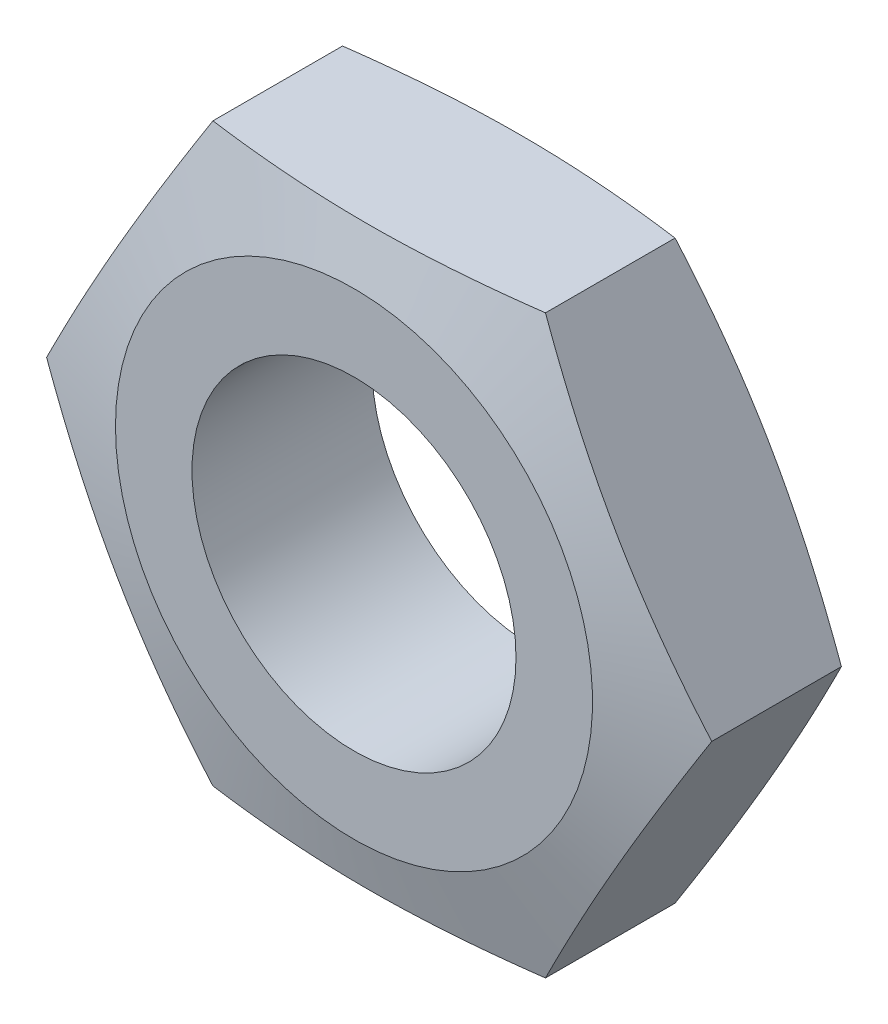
from build123d import *

# Parameters (mm, degrees)
ESQUISSE1_R          = 4.5
BASE_EXTRUSION_DEPTH = 2.5


with BuildPart() as part:
    # Esquisse1 → Base-Extrusion (new, symmetric)
    with BuildSketch(Plane.XY):
        Polygon((-4.618802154, 8), (4.618802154, 8), (9.237604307, 0), (4.618802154, -8), (-4.618802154, -8), (-9.237604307, 0), align=None)
        Circle(ESQUISSE1_R, mode=Mode.SUBTRACT)
    extrude(amount=BASE_EXTRUSION_DEPTH, both=True)

    # Esquisse2 → Enlever de la mati_re-R_volution1 (revolve, cut)
    with BuildSketch(Plane(origin=(0, 0, 0), x_dir=(1, 0, 0), z_dir=(0, 1, 0)), mode=Mode.PRIVATE) as enlever_de_la_mati_re_r_volution1_sk:
        Polygon((6.625168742, 2.5), (9.237604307, 1.8), (9.237604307, 2.5), align=None)
    enlever_de_la_mati_re_r_volution1 = revolve(enlever_de_la_mati_re_r_volution1_sk.sketch.rotate(Axis((0, 0, -6.869034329), (0, 0, 1)), 180), axis=Axis((0, 0, -6.869034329), (0, 0, 1)), mode=Mode.SUBTRACT)

    # Sym_trie1: Enlever de la mati_re-R_volution1 across plane
    add(enlever_de_la_mati_re_r_volution1.mirror(Plane.XY), mode=Mode.SUBTRACT)


solid = part.part
